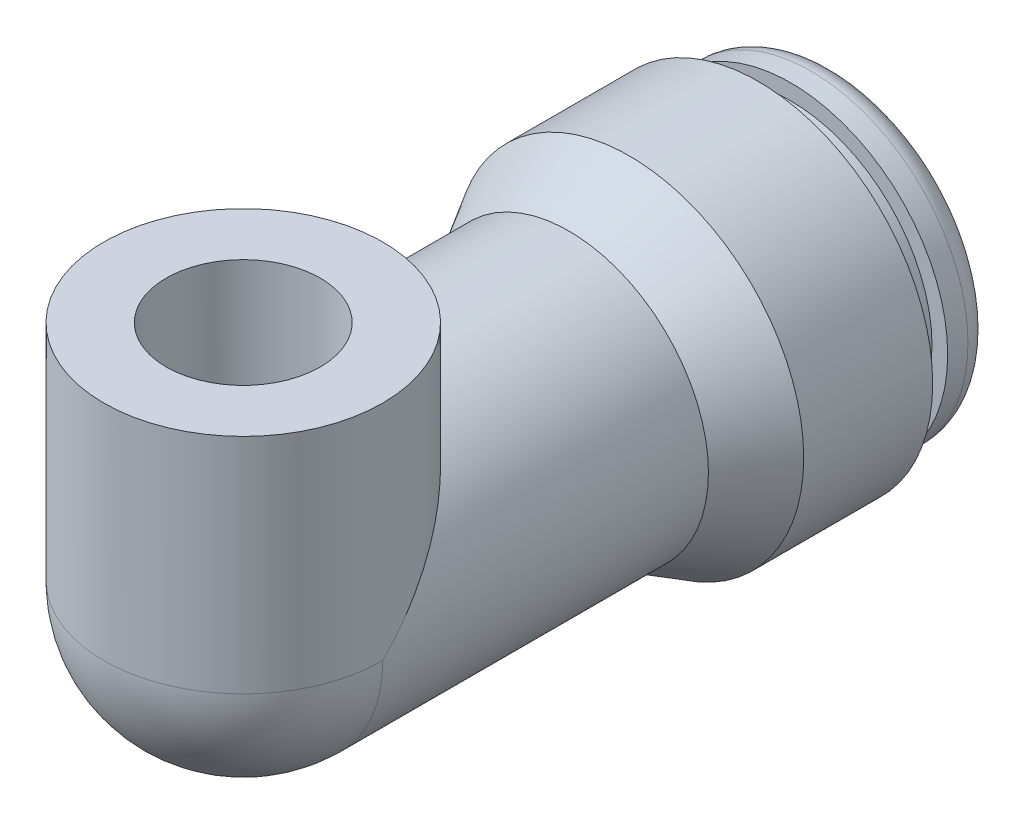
ISO-10303-21;
HEADER;
FILE_DESCRIPTION(('STEP AP214'),'2;1');
FILE_NAME('part.step','',(''),(''),'','','');
FILE_SCHEMA(('AUTOMOTIVE_DESIGN { 1 0 10303 214 1 1 1 1 }'));
ENDSEC;
DATA;
#1=APPLICATION_CONTEXT('core data for automotive mechanical design processes');
#2=APPLICATION_PROTOCOL_DEFINITION('international standard','automotive_design',2000,#1);
#3=PRODUCT_CONTEXT('',#1,'mechanical');
#4=PRODUCT('Part','Part','',(#3));
#5=PRODUCT_RELATED_PRODUCT_CATEGORY('part','',(#4));
#6=PRODUCT_DEFINITION_FORMATION('','',#4);
#7=PRODUCT_DEFINITION_CONTEXT('part definition',#1,'design');
#8=PRODUCT_DEFINITION('design','',#6,#7);
#9=PRODUCT_DEFINITION_SHAPE('','',#8);
#10=(LENGTH_UNIT() NAMED_UNIT(*) SI_UNIT(.MILLI.,.METRE.));
#11=(NAMED_UNIT(*) PLANE_ANGLE_UNIT() SI_UNIT($,.RADIAN.));
#12=(NAMED_UNIT(*) SI_UNIT($,.STERADIAN.) SOLID_ANGLE_UNIT());
#13=UNCERTAINTY_MEASURE_WITH_UNIT(LENGTH_MEASURE(1.E-05),#10,'distance_accuracy_value','');
#14=(GEOMETRIC_REPRESENTATION_CONTEXT(3) GLOBAL_UNCERTAINTY_ASSIGNED_CONTEXT((#13)) GLOBAL_UNIT_ASSIGNED_CONTEXT((#10,
#11,#12)) REPRESENTATION_CONTEXT('',''));
#15=CARTESIAN_POINT('',(0.,0.,0.));
#16=DIRECTION('',(0.,0.,1.));
#17=DIRECTION('',(1.,0.,0.));
#18=AXIS2_PLACEMENT_3D('',#15,#16,#17);
#19=CARTESIAN_POINT('',(0.,6.98499999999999,0.));
#20=DIRECTION('',(0.,-1.,0.));
#21=DIRECTION('',(0.,0.,-1.));
#22=AXIS2_PLACEMENT_3D('',#19,#20,#21);
#23=CYLINDRICAL_SURFACE('',#22,2.413);
#24=CARTESIAN_POINT('',(0.,0.,0.));
#25=DIRECTION('',(0.,-0.707106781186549,-0.707106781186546));
#26=DIRECTION('',(0.,-0.707106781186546,0.707106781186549));
#27=AXIS2_PLACEMENT_3D('',#24,#25,#26);
#28=ELLIPSE('',#27,3.41249732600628,2.413);
#29=CARTESIAN_POINT('',(2.413,0.,0.));
#30=VERTEX_POINT('',#29);
#31=CARTESIAN_POINT('',(-2.413,0.,0.));
#32=VERTEX_POINT('',#31);
#33=EDGE_CURVE('E60',#30,#32,#28,.F.);
#34=ORIENTED_EDGE('',*,*,#33,.F.);
#35=CARTESIAN_POINT('',(0.,0.,0.));
#36=DIRECTION('',(0.,-1.,0.));
#37=DIRECTION('',(1.,0.,0.));
#38=AXIS2_PLACEMENT_3D('',#35,#36,#37);
#39=CIRCLE('',#38,2.413);
#40=EDGE_CURVE('E64',#30,#32,#39,.T.);
#41=ORIENTED_EDGE('',*,*,#40,.T.);
#42=EDGE_LOOP('',(#34,#41));
#43=FACE_BOUND('',#42,.T.);
#44=CARTESIAN_POINT('',(0.,6.98499999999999,0.));
#45=DIRECTION('',(0.,1.,0.));
#46=DIRECTION('',(0.,0.,1.));
#47=AXIS2_PLACEMENT_3D('',#44,#45,#46);
#48=CIRCLE('',#47,2.413);
#49=CARTESIAN_POINT('',(0.,6.985,2.41299999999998));
#50=VERTEX_POINT('',#49);
#51=EDGE_CURVE('E67',#50,#50,#48,.F.);
#52=ORIENTED_EDGE('',*,*,#51,.F.);
#53=EDGE_LOOP('',(#52));
#54=FACE_BOUND('',#53,.T.);
#55=ADVANCED_FACE('F32',(#43,#54),#23,.F.);
#56=CARTESIAN_POINT('',(0.,6.98499999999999,0.));
#57=DIRECTION('',(0.,1.,0.));
#58=DIRECTION('',(0.,0.,1.));
#59=AXIS2_PLACEMENT_3D('',#56,#57,#58);
#60=PLANE('',#59);
#61=CARTESIAN_POINT('',(0.,6.98499999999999,0.));
#62=DIRECTION('',(0.,1.,0.));
#63=DIRECTION('',(0.,0.,1.));
#64=AXIS2_PLACEMENT_3D('',#61,#62,#63);
#65=CIRCLE('',#64,4.3688);
#66=CARTESIAN_POINT('',(0.,6.98500000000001,4.36879999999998));
#67=VERTEX_POINT('',#66);
#68=EDGE_CURVE('E88',#67,#67,#65,.T.);
#69=ORIENTED_EDGE('',*,*,#68,.T.);
#70=EDGE_LOOP('',(#69));
#71=FACE_BOUND('',#70,.T.);
#72=ORIENTED_EDGE('',*,*,#51,.T.);
#73=EDGE_LOOP('',(#72));
#74=FACE_BOUND('',#73,.T.);
#75=ADVANCED_FACE('F187',(#71,#74),#60,.T.);
#76=CARTESIAN_POINT('',(0.,0.,0.));
#77=DIRECTION('',(0.,0.,1.));
#78=DIRECTION('',(1.,0.,0.));
#79=AXIS2_PLACEMENT_3D('',#76,#77,#78);
#80=CYLINDRICAL_SURFACE('',#79,3.175);
#81=CARTESIAN_POINT('',(0.,0.,-18.161));
#82=DIRECTION('',(0.,0.,1.));
#83=DIRECTION('',(1.,0.,0.));
#84=AXIS2_PLACEMENT_3D('',#81,#82,#83);
#85=CIRCLE('',#84,3.175);
#86=CARTESIAN_POINT('',(3.175,0.,-18.161));
#87=VERTEX_POINT('',#86);
#88=EDGE_CURVE('E79',#87,#87,#85,.T.);
#89=ORIENTED_EDGE('',*,*,#88,.F.);
#90=EDGE_LOOP('',(#89));
#91=FACE_BOUND('',#90,.T.);
#92=CARTESIAN_POINT('',(0.,0.,-4.3688));
#93=DIRECTION('',(0.,0.,1.));
#94=DIRECTION('',(1.,0.,0.));
#95=AXIS2_PLACEMENT_3D('',#92,#93,#94);
#96=CIRCLE('',#95,3.175);
#97=CARTESIAN_POINT('',(3.175,0.,-4.3688));
#98=VERTEX_POINT('',#97);
#99=EDGE_CURVE('E11',#98,#98,#96,.F.);
#100=ORIENTED_EDGE('',*,*,#99,.F.);
#101=EDGE_LOOP('',(#100));
#102=FACE_BOUND('',#101,.T.);
#103=ADVANCED_FACE('F34',(#91,#102),#80,.F.);
#104=CARTESIAN_POINT('',(0.,0.,0.));
#105=DIRECTION('',(0.,0.,1.));
#106=DIRECTION('',(1.,0.,0.));
#107=AXIS2_PLACEMENT_3D('',#104,#105,#106);
#108=CYLINDRICAL_SURFACE('',#107,4.3688);
#109=CARTESIAN_POINT('',(0.,0.,0.));
#110=DIRECTION('',(0.,0.,1.));
#111=DIRECTION('',(1.,0.,0.));
#112=AXIS2_PLACEMENT_3D('',#109,#110,#111);
#113=CIRCLE('',#112,4.3688);
#114=CARTESIAN_POINT('',(-4.3688,0.,0.));
#115=VERTEX_POINT('',#114);
#116=CARTESIAN_POINT('',(4.3688,0.,0.));
#117=VERTEX_POINT('',#116);
#118=EDGE_CURVE('E48',#115,#117,#113,.T.);
#119=ORIENTED_EDGE('',*,*,#118,.F.);
#120=CARTESIAN_POINT('',(0.,0.,0.));
#121=DIRECTION('',(0.,0.707106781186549,0.707106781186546));
#122=DIRECTION('',(0.,-0.707106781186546,0.707106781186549));
#123=AXIS2_PLACEMENT_3D('',#120,#121,#122);
#124=ELLIPSE('',#123,6.17841621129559,4.3688);
#125=EDGE_CURVE('E52',#115,#117,#124,.F.);
#126=ORIENTED_EDGE('',*,*,#125,.T.);
#127=EDGE_LOOP('',(#119,#126));
#128=FACE_BOUND('',#127,.T.);
#129=CARTESIAN_POINT('',(0.,0.,-10.1981));
#130=DIRECTION('',(0.,0.,1.));
#131=DIRECTION('',(1.,0.,0.));
#132=AXIS2_PLACEMENT_3D('',#129,#130,#131);
#133=CIRCLE('',#132,4.3688);
#134=CARTESIAN_POINT('',(4.3688,0.,-10.1981));
#135=VERTEX_POINT('',#134);
#136=EDGE_CURVE('E41',#135,#135,#133,.T.);
#137=ORIENTED_EDGE('',*,*,#136,.T.);
#138=EDGE_LOOP('',(#137));
#139=FACE_BOUND('',#138,.T.);
#140=ADVANCED_FACE('F128',(#128,#139),#108,.T.);
#141=CARTESIAN_POINT('',(0.,0.,-12.0898458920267));
#142=DIRECTION('',(0.,0.,-1.));
#143=DIRECTION('',(-1.,0.,0.));
#144=AXIS2_PLACEMENT_3D('',#141,#142,#143);
#145=CONICAL_SURFACE('',#144,5.461,0.523598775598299);
#146=ORIENTED_EDGE('',*,*,#136,.F.);
#147=EDGE_LOOP('',(#146));
#148=FACE_BOUND('',#147,.T.);
#149=CARTESIAN_POINT('',(0.,0.,-12.0898458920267));
#150=DIRECTION('',(0.,0.,1.));
#151=DIRECTION('',(1.,0.,0.));
#152=AXIS2_PLACEMENT_3D('',#149,#150,#151);
#153=CIRCLE('',#152,5.461);
#154=CARTESIAN_POINT('',(5.461,0.,-12.0898458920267));
#155=VERTEX_POINT('',#154);
#156=EDGE_CURVE('E122',#155,#155,#153,.T.);
#157=ORIENTED_EDGE('',*,*,#156,.T.);
#158=EDGE_LOOP('',(#157));
#159=FACE_BOUND('',#158,.T.);
#160=ADVANCED_FACE('F130',(#148,#159),#145,.T.);
#161=CARTESIAN_POINT('',(0.,0.,0.));
#162=DIRECTION('',(0.,0.,1.));
#163=DIRECTION('',(1.,0.,0.));
#164=AXIS2_PLACEMENT_3D('',#161,#162,#163);
#165=CYLINDRICAL_SURFACE('',#164,5.461);
#166=ORIENTED_EDGE('',*,*,#156,.F.);
#167=EDGE_LOOP('',(#166));
#168=FACE_BOUND('',#167,.T.);
#169=CARTESIAN_POINT('',(0.,0.,-16.129));
#170=DIRECTION('',(0.,0.,1.));
#171=DIRECTION('',(1.,0.,0.));
#172=AXIS2_PLACEMENT_3D('',#169,#170,#171);
#173=CIRCLE('',#172,5.461);
#174=CARTESIAN_POINT('',(5.461,0.,-16.129));
#175=VERTEX_POINT('',#174);
#176=EDGE_CURVE('E119',#175,#175,#173,.T.);
#177=ORIENTED_EDGE('',*,*,#176,.T.);
#178=EDGE_LOOP('',(#177));
#179=FACE_BOUND('',#178,.T.);
#180=ADVANCED_FACE('F133',(#168,#179),#165,.T.);
#181=CARTESIAN_POINT('',(0.,5.461,-16.129));
#182=DIRECTION('',(0.,0.,1.));
#183=DIRECTION('',(1.,0.,0.));
#184=AXIS2_PLACEMENT_3D('',#181,#182,#183);
#185=PLANE('',#184);
#186=ORIENTED_EDGE('',*,*,#176,.F.);
#187=EDGE_LOOP('',(#186));
#188=FACE_BOUND('',#187,.T.);
#189=CARTESIAN_POINT('',(0.,0.,-16.129));
#190=DIRECTION('',(0.,0.,1.));
#191=DIRECTION('',(1.,0.,0.));
#192=AXIS2_PLACEMENT_3D('',#189,#190,#191);
#193=CIRCLE('',#192,4.42341);
#194=CARTESIAN_POINT('',(4.42341,0.,-16.129));
#195=VERTEX_POINT('',#194);
#196=EDGE_CURVE('E116',#195,#195,#193,.T.);
#197=ORIENTED_EDGE('',*,*,#196,.T.);
#198=EDGE_LOOP('',(#197));
#199=FACE_BOUND('',#198,.T.);
#200=ADVANCED_FACE('F139',(#188,#199),#185,.F.);
#201=CARTESIAN_POINT('',(0.,0.,0.));
#202=DIRECTION('',(0.,0.,1.));
#203=DIRECTION('',(1.,0.,0.));
#204=AXIS2_PLACEMENT_3D('',#201,#202,#203);
#205=CYLINDRICAL_SURFACE('',#204,4.42341);
#206=ORIENTED_EDGE('',*,*,#196,.F.);
#207=EDGE_LOOP('',(#206));
#208=FACE_BOUND('',#207,.T.);
#209=CARTESIAN_POINT('',(0.,0.,-17.145));
#210=DIRECTION('',(0.,0.,1.));
#211=DIRECTION('',(1.,0.,0.));
#212=AXIS2_PLACEMENT_3D('',#209,#210,#211);
#213=CIRCLE('',#212,4.42341);
#214=CARTESIAN_POINT('',(4.42341,0.,-17.145));
#215=VERTEX_POINT('',#214);
#216=EDGE_CURVE('E113',#215,#215,#213,.T.);
#217=ORIENTED_EDGE('',*,*,#216,.T.);
#218=EDGE_LOOP('',(#217));
#219=FACE_BOUND('',#218,.T.);
#220=ADVANCED_FACE('F145',(#208,#219),#205,.T.);
#221=CARTESIAN_POINT('',(0.,4.9149,-17.145));
#222=DIRECTION('',(0.,0.,-1.));
#223=DIRECTION('',(-1.,0.,0.));
#224=AXIS2_PLACEMENT_3D('',#221,#222,#223);
#225=PLANE('',#224);
#226=ORIENTED_EDGE('',*,*,#216,.F.);
#227=EDGE_LOOP('',(#226));
#228=FACE_BOUND('',#227,.T.);
#229=CARTESIAN_POINT('',(0.,0.,-17.145));
#230=DIRECTION('',(0.,0.,1.));
#231=DIRECTION('',(1.,0.,0.));
#232=AXIS2_PLACEMENT_3D('',#229,#230,#231);
#233=CIRCLE('',#232,4.9149);
#234=CARTESIAN_POINT('',(4.9149,0.,-17.145));
#235=VERTEX_POINT('',#234);
#236=EDGE_CURVE('E110',#235,#235,#233,.T.);
#237=ORIENTED_EDGE('',*,*,#236,.T.);
#238=EDGE_LOOP('',(#237));
#239=FACE_BOUND('',#238,.T.);
#240=ADVANCED_FACE('F151',(#228,#239),#225,.F.);
#241=CARTESIAN_POINT('',(0.,0.,0.));
#242=DIRECTION('',(0.,0.,1.));
#243=DIRECTION('',(1.,0.,0.));
#244=AXIS2_PLACEMENT_3D('',#241,#242,#243);
#245=CYLINDRICAL_SURFACE('',#244,4.9149);
#246=ORIENTED_EDGE('',*,*,#236,.F.);
#247=EDGE_LOOP('',(#246));
#248=FACE_BOUND('',#247,.T.);
#249=CARTESIAN_POINT('',(0.,0.,-17.78));
#250=DIRECTION('',(0.,0.,1.));
#251=DIRECTION('',(1.,0.,0.));
#252=AXIS2_PLACEMENT_3D('',#249,#250,#251);
#253=CIRCLE('',#252,4.9149);
#254=CARTESIAN_POINT('',(4.9149,0.,-17.78));
#255=VERTEX_POINT('',#254);
#256=EDGE_CURVE('E107',#255,#255,#253,.T.);
#257=ORIENTED_EDGE('',*,*,#256,.T.);
#258=EDGE_LOOP('',(#257));
#259=FACE_BOUND('',#258,.T.);
#260=ADVANCED_FACE('F157',(#248,#259),#245,.T.);
#261=CARTESIAN_POINT('',(0.,0.,-17.78));
#262=DIRECTION('',(0.,0.,1.));
#263=DIRECTION('',(1.,0.,0.));
#264=AXIS2_PLACEMENT_3D('',#261,#262,#263);
#265=TOROIDAL_SURFACE('',#264,4.1529,0.761999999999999);
#266=ORIENTED_EDGE('',*,*,#256,.F.);
#267=EDGE_LOOP('',(#266));
#268=FACE_BOUND('',#267,.T.);
#269=CARTESIAN_POINT('',(0.,0.,-18.542));
#270=DIRECTION('',(0.,0.,1.));
#271=DIRECTION('',(1.,0.,0.));
#272=AXIS2_PLACEMENT_3D('',#269,#270,#271);
#273=CIRCLE('',#272,4.1529);
#274=CARTESIAN_POINT('',(4.1529,0.,-18.542));
#275=VERTEX_POINT('',#274);
#276=EDGE_CURVE('E104',#275,#275,#273,.T.);
#277=ORIENTED_EDGE('',*,*,#276,.T.);
#278=EDGE_LOOP('',(#277));
#279=FACE_BOUND('',#278,.T.);
#280=ADVANCED_FACE('F163',(#268,#279),#265,.T.);
#281=CARTESIAN_POINT('',(0.,4.1529,-18.542));
#282=DIRECTION('',(0.,0.,1.));
#283=DIRECTION('',(1.,0.,0.));
#284=AXIS2_PLACEMENT_3D('',#281,#282,#283);
#285=PLANE('',#284);
#286=ORIENTED_EDGE('',*,*,#276,.F.);
#287=EDGE_LOOP('',(#286));
#288=FACE_BOUND('',#287,.T.);
#289=CARTESIAN_POINT('',(0.,0.,-18.542));
#290=DIRECTION('',(0.,0.,1.));
#291=DIRECTION('',(1.,0.,0.));
#292=AXIS2_PLACEMENT_3D('',#289,#290,#291);
#293=CIRCLE('',#292,3.556);
#294=CARTESIAN_POINT('',(3.556,0.,-18.542));
#295=VERTEX_POINT('',#294);
#296=EDGE_CURVE('E101',#295,#295,#293,.T.);
#297=ORIENTED_EDGE('',*,*,#296,.T.);
#298=EDGE_LOOP('',(#297));
#299=FACE_BOUND('',#298,.T.);
#300=ADVANCED_FACE('F169',(#288,#299),#285,.F.);
#301=CARTESIAN_POINT('',(0.,0.,-18.161));
#302=DIRECTION('',(0.,0.,-1.));
#303=DIRECTION('',(-1.,0.,0.));
#304=AXIS2_PLACEMENT_3D('',#301,#302,#303);
#305=CONICAL_SURFACE('',#304,3.175,0.785398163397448);
#306=ORIENTED_EDGE('',*,*,#296,.F.);
#307=EDGE_LOOP('',(#306));
#308=FACE_BOUND('',#307,.T.);
#309=ORIENTED_EDGE('',*,*,#88,.T.);
#310=EDGE_LOOP('',(#309));
#311=FACE_BOUND('',#310,.T.);
#312=ADVANCED_FACE('F175',(#308,#311),#305,.F.);
#313=CARTESIAN_POINT('',(0.,0.,-4.3688));
#314=DIRECTION('',(0.,0.,1.));
#315=DIRECTION('',(1.,0.,0.));
#316=AXIS2_PLACEMENT_3D('',#313,#314,#315);
#317=PLANE('',#316);
#318=ORIENTED_EDGE('',*,*,#99,.T.);
#319=EDGE_LOOP('',(#318));
#320=FACE_BOUND('',#319,.T.);
#321=CARTESIAN_POINT('',(0.,0.,-4.3688));
#322=DIRECTION('',(0.,0.,1.));
#323=DIRECTION('',(1.,0.,0.));
#324=AXIS2_PLACEMENT_3D('',#321,#322,#323);
#325=CIRCLE('',#324,2.413);
#326=CARTESIAN_POINT('',(2.413,0.,-4.3688));
#327=VERTEX_POINT('',#326);
#328=EDGE_CURVE('E76',#327,#327,#325,.T.);
#329=ORIENTED_EDGE('',*,*,#328,.T.);
#330=EDGE_LOOP('',(#329));
#331=FACE_BOUND('',#330,.T.);
#332=ADVANCED_FACE('F181',(#320,#331),#317,.F.);
#333=CARTESIAN_POINT('',(0.,0.,-4.3688));
#334=DIRECTION('',(0.,0.,1.));
#335=DIRECTION('',(1.,0.,0.));
#336=AXIS2_PLACEMENT_3D('',#333,#334,#335);
#337=CYLINDRICAL_SURFACE('',#336,2.413);
#338=CARTESIAN_POINT('',(0.,0.,0.));
#339=DIRECTION('',(0.,0.,-1.));
#340=DIRECTION('',(1.,0.,0.));
#341=AXIS2_PLACEMENT_3D('',#338,#339,#340);
#342=CIRCLE('',#341,2.413);
#343=EDGE_CURVE('E69',#30,#32,#342,.T.);
#344=ORIENTED_EDGE('',*,*,#343,.F.);
#345=ORIENTED_EDGE('',*,*,#33,.T.);
#346=EDGE_LOOP('',(#344,#345));
#347=FACE_BOUND('',#346,.T.);
#348=ORIENTED_EDGE('',*,*,#328,.F.);
#349=EDGE_LOOP('',(#348));
#350=FACE_BOUND('',#349,.T.);
#351=ADVANCED_FACE('F70',(#347,#350),#337,.F.);
#352=CARTESIAN_POINT('',(0.,0.,0.));
#353=DIRECTION('',(1.,0.,0.));
#354=DIRECTION('',(0.,0.,-1.));
#355=AXIS2_PLACEMENT_3D('',#352,#353,#354);
#356=SPHERICAL_SURFACE('',#355,4.3688);
#357=ORIENTED_EDGE('',*,*,#118,.T.);
#358=CARTESIAN_POINT('',(0.,0.,0.));
#359=DIRECTION('',(0.,1.,0.));
#360=DIRECTION('',(1.,0.,0.));
#361=AXIS2_PLACEMENT_3D('',#358,#359,#360);
#362=CIRCLE('',#361,4.3688);
#363=EDGE_CURVE('E73',#115,#117,#362,.T.);
#364=ORIENTED_EDGE('',*,*,#363,.F.);
#365=EDGE_LOOP('',(#357,#364));
#366=FACE_BOUND('',#365,.T.);
#367=ADVANCED_FACE('F195',(#366),#356,.T.);
#368=CARTESIAN_POINT('',(0.,0.,0.));
#369=DIRECTION('',(1.,0.,0.));
#370=DIRECTION('',(0.,0.,1.));
#371=AXIS2_PLACEMENT_3D('',#368,#369,#370);
#372=SPHERICAL_SURFACE('',#371,2.413);
#373=ORIENTED_EDGE('',*,*,#343,.T.);
#374=ORIENTED_EDGE('',*,*,#40,.F.);
#375=EDGE_LOOP('',(#373,#374));
#376=FACE_BOUND('',#375,.T.);
#377=ADVANCED_FACE('F75',(#376),#372,.F.);
#378=CARTESIAN_POINT('',(0.,6.98499999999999,0.));
#379=DIRECTION('',(0.,-1.,0.));
#380=DIRECTION('',(0.,0.,-1.));
#381=AXIS2_PLACEMENT_3D('',#378,#379,#380);
#382=CYLINDRICAL_SURFACE('',#381,4.3688);
#383=ORIENTED_EDGE('',*,*,#363,.T.);
#384=ORIENTED_EDGE('',*,*,#125,.F.);
#385=EDGE_LOOP('',(#383,#384));
#386=FACE_BOUND('',#385,.T.);
#387=ORIENTED_EDGE('',*,*,#68,.F.);
#388=EDGE_LOOP('',(#387));
#389=FACE_BOUND('',#388,.T.);
#390=ADVANCED_FACE('F209',(#386,#389),#382,.T.);
#391=CLOSED_SHELL('',(#55,#75,#103,#140,#160,#180,#200,#220,#240,#260,#280,#300,#312,#332,#351,
#367,#377,#390));
#392=MANIFOLD_SOLID_BREP('B2',#391);
#393=ADVANCED_BREP_SHAPE_REPRESENTATION('',(#18,#392),#14);
#394=SHAPE_DEFINITION_REPRESENTATION(#9,#393);
ENDSEC;
END-ISO-10303-21;
